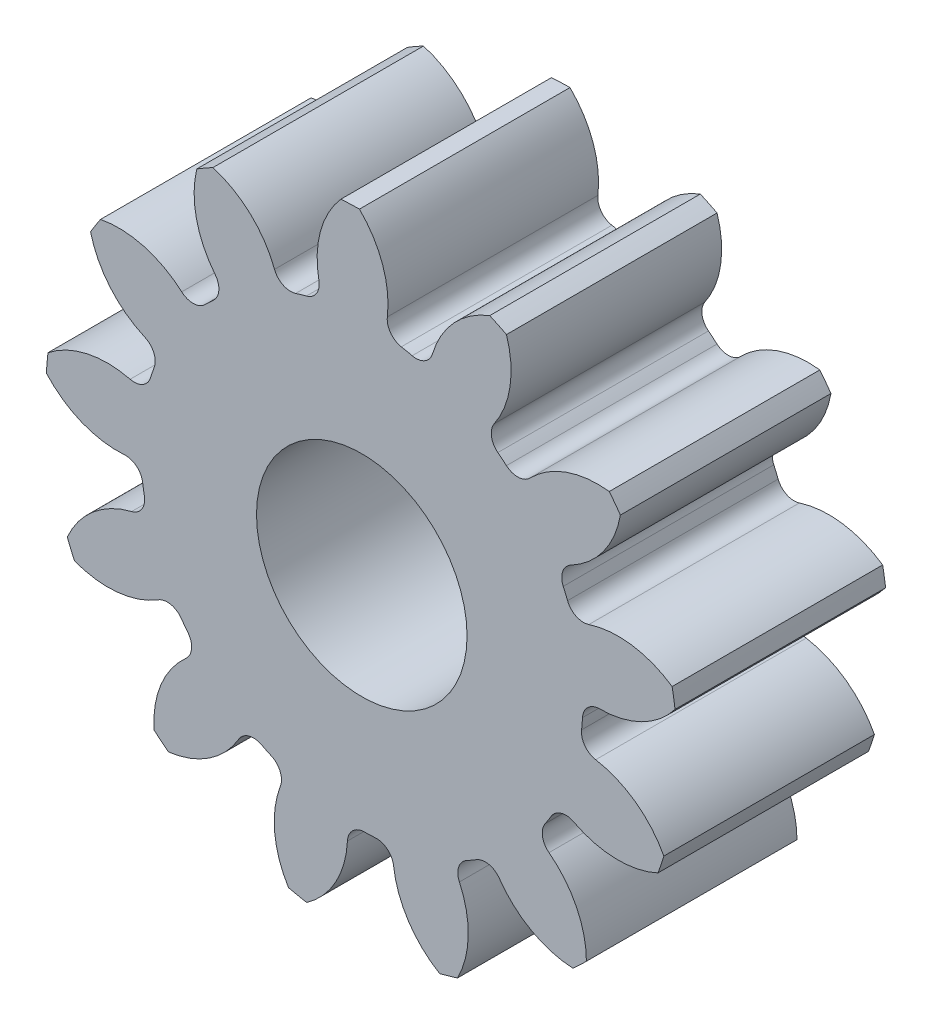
from build123d import *

# Parameters (mm, degrees)
SKETCH3_R         = 152.4
GEARBODY_DEPTH    = 101.6
TOOTHCUT_DEPTH    = 239.273120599
CIRPATTERN1_COUNT = 13
BOREDIA_R         = 50.8
BORE_DEPTH        = 12700


with BuildPart() as part:
    # Sketch3 → gearBody (new body)
    with BuildSketch(Plane.XY):
        Circle(SKETCH3_R)
    extrude(amount=GEARBODY_DEPTH)

    # Sketch2 → toothCut (cut, through all)
    with BuildSketch(Plane.XY):
        with BuildLine():
            ThreePointArc((106.045473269, -11.618089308), (106.303862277, -8.950489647), (106.495157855, -6.277240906))
            ThreePointArc((106.495157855, -6.277240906), (109.073122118, -0.750741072), (114.738245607, 1.506353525))
            ThreePointArc((114.738245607, 1.506353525), (135.980960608, 6.743435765), (152.4, 21.203557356))
            ThreePointArc((152.4, 21.203557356), (153.325450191, -12.909576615), (146.70900373, -46.387703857))
            ThreePointArc((146.70900373, -46.387703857), (132.938983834, -29.385747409), (112.871022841, -20.670421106))
            ThreePointArc((112.871022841, -20.670421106), (107.66306269, -17.497843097), (106.045473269, -11.618089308))
        make_face()
    toothcut = extrude(amount=TOOTHCUT_DEPTH, mode=Mode.SUBTRACT)

    # CirPattern1: toothCut ×13 about axis
    cirpattern1_axis = Axis((0, 0, 0), (0, 0, 1))
    for i in range(1, CIRPATTERN1_COUNT):
        add(toothcut.rotate(cirpattern1_axis, i * 360 / CIRPATTERN1_COUNT), mode=Mode.SUBTRACT)

    # boreDia → bore (cut, symmetric)
    with BuildSketch(Plane.XY):
        Circle(BOREDIA_R)
    extrude(amount=BORE_DEPTH, both=True, mode=Mode.SUBTRACT)


solid = part.part
